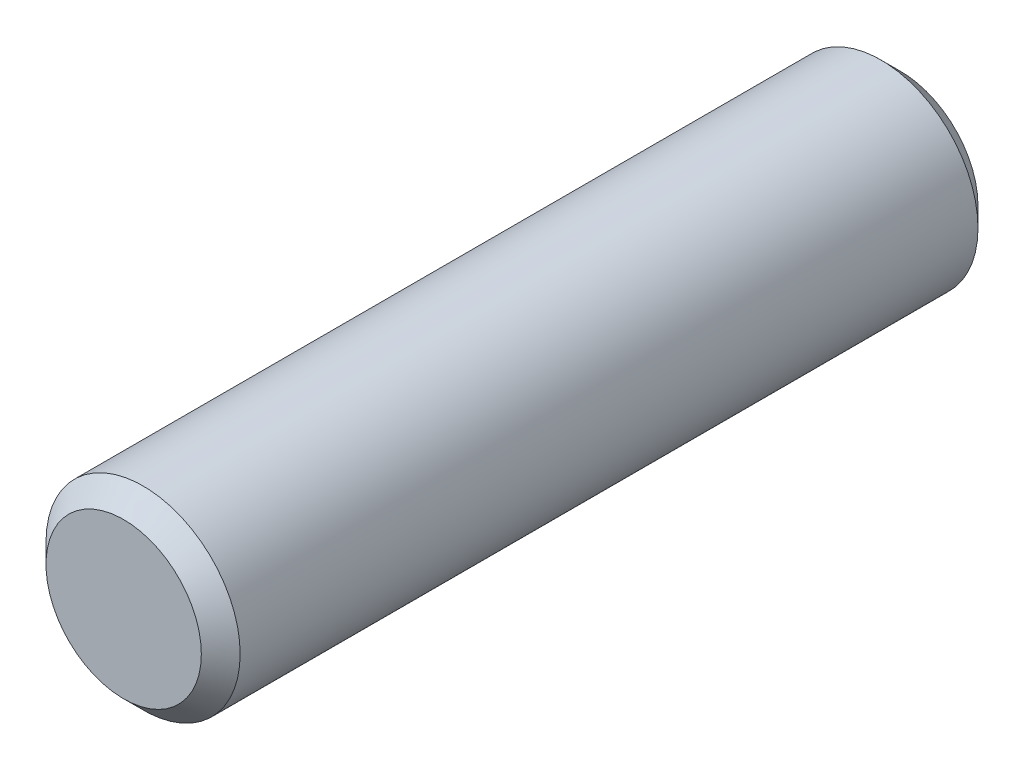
from build123d import *

# Parameters (mm, degrees)
SKETCH_2_R          = 1.5
EXTRUDE_1_DEPTH     = 12
CUT_EXTRUDE_1_DEPTH = 1.2
CHAMFER_1_SIZE      = 0.3


with BuildPart() as part:
    # Sketch 2 → Extrude 1 (new body)
    with BuildSketch(Plane.XY):
        Circle(SKETCH_2_R)
    extrude(amount=EXTRUDE_1_DEPTH)

    # Sketch 3 → Cut-Extrude 1 (cut)
    with BuildSketch(Plane(origin=(0, 0, 0), x_dir=(-1, 0, 0), z_dir=(0, 0, -1))):
        Polygon((0.866025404, 0), (0.433012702, 0.75), (-0.433012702, 0.75), (-0.866025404, 0), (-0.433012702, -0.75), (0.433012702, -0.75), align=None)
    extrude(amount=-CUT_EXTRUDE_1_DEPTH, mode=Mode.SUBTRACT)

    # Sketch 5 → Cut-Revolve 1 (revolve, cut)
    with BuildSketch(Plane(origin=(0, 0, 0), x_dir=(0, 0, -1), z_dir=(1, 0, 0))):
        Polygon((-1.2, 0.75), (-1.472977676, 0), (-1.2, 0), align=None)
    revolve(axis=Axis((0, 0, 1.575163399), (0, 0, -1)), mode=Mode.SUBTRACT)

    # Chamfer 1
    chamfer_1_edges = [part.edges().sort_by_distance(p)[0] for p in [
        (-1.5, 0, 0),
        (-1.5, 0, 12),
    ]]
    chamfer(chamfer_1_edges, length=CHAMFER_1_SIZE)


solid = part.part
